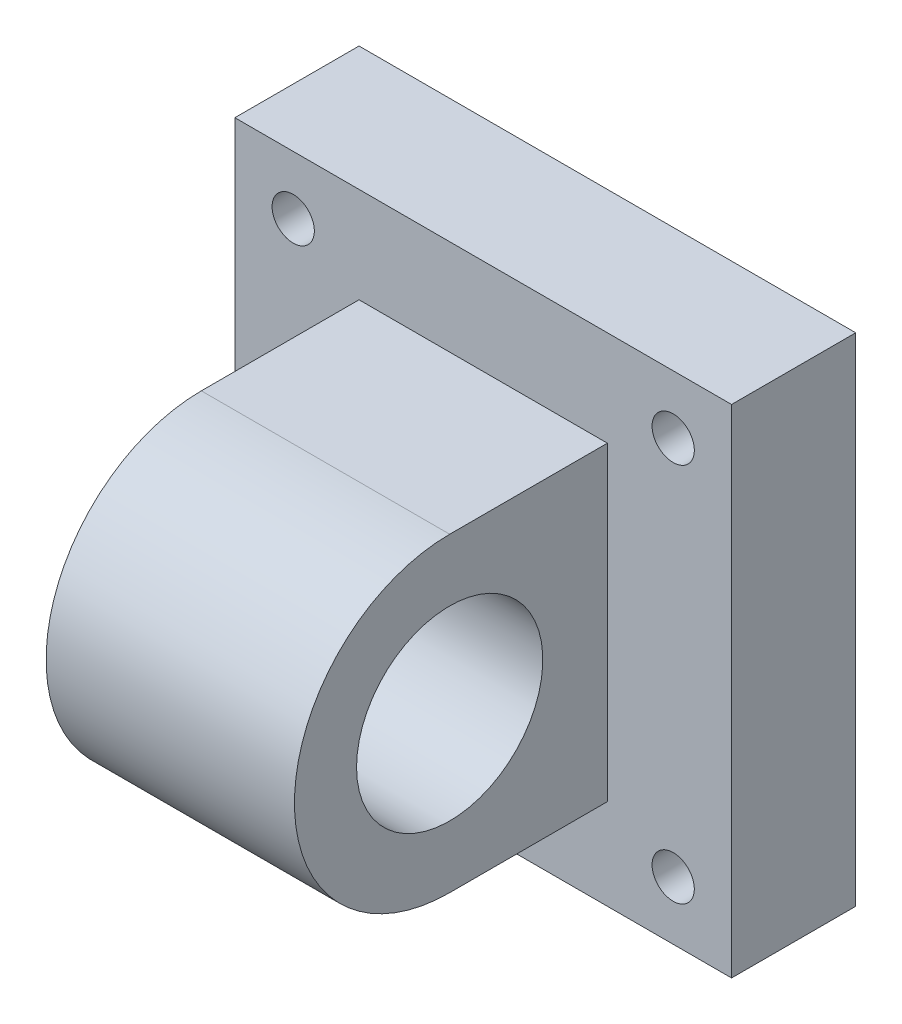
ISO-10303-21;
HEADER;
FILE_DESCRIPTION(('STEP AP214'),'2;1');
FILE_NAME('part.step','',(''),(''),'','','');
FILE_SCHEMA(('AUTOMOTIVE_DESIGN { 1 0 10303 214 1 1 1 1 }'));
ENDSEC;
DATA;
#1=APPLICATION_CONTEXT('core data for automotive mechanical design processes');
#2=APPLICATION_PROTOCOL_DEFINITION('international standard','automotive_design',2000,#1);
#3=PRODUCT_CONTEXT('',#1,'mechanical');
#4=PRODUCT('Part','Part','',(#3));
#5=PRODUCT_RELATED_PRODUCT_CATEGORY('part','',(#4));
#6=PRODUCT_DEFINITION_FORMATION('','',#4);
#7=PRODUCT_DEFINITION_CONTEXT('part definition',#1,'design');
#8=PRODUCT_DEFINITION('design','',#6,#7);
#9=PRODUCT_DEFINITION_SHAPE('','',#8);
#10=(LENGTH_UNIT() NAMED_UNIT(*) SI_UNIT(.MILLI.,.METRE.));
#11=(NAMED_UNIT(*) PLANE_ANGLE_UNIT() SI_UNIT($,.RADIAN.));
#12=(NAMED_UNIT(*) SI_UNIT($,.STERADIAN.) SOLID_ANGLE_UNIT());
#13=UNCERTAINTY_MEASURE_WITH_UNIT(LENGTH_MEASURE(1.E-05),#10,'distance_accuracy_value','');
#14=(GEOMETRIC_REPRESENTATION_CONTEXT(3) GLOBAL_UNCERTAINTY_ASSIGNED_CONTEXT((#13)) GLOBAL_UNIT_ASSIGNED_CONTEXT((#10,
#11,#12)) REPRESENTATION_CONTEXT('',''));
#15=CARTESIAN_POINT('',(0.,0.,0.));
#16=DIRECTION('',(0.,0.,1.));
#17=DIRECTION('',(1.,0.,0.));
#18=AXIS2_PLACEMENT_3D('',#15,#16,#17);
#19=CARTESIAN_POINT('',(0.,0.,10.));
#20=DIRECTION('',(0.,0.,-1.));
#21=DIRECTION('',(-1.,0.,0.));
#22=AXIS2_PLACEMENT_3D('',#19,#20,#21);
#23=PLANE('',#22);
#24=CARTESIAN_POINT('',(15.3,-15.3,10.));
#25=DIRECTION('',(0.,0.,-1.));
#26=DIRECTION('',(-1.,0.,0.));
#27=AXIS2_PLACEMENT_3D('',#24,#25,#26);
#28=CIRCLE('',#27,1.7);
#29=CARTESIAN_POINT('',(13.6,-15.3,10.));
#30=VERTEX_POINT('',#29);
#31=EDGE_CURVE('E244',#30,#30,#28,.T.);
#32=ORIENTED_EDGE('',*,*,#31,.T.);
#33=EDGE_LOOP('',(#32));
#34=FACE_BOUND('',#33,.T.);
#35=CARTESIAN_POINT('',(15.3,15.3,10.));
#36=DIRECTION('',(0.,0.,-1.));
#37=DIRECTION('',(-1.,0.,0.));
#38=AXIS2_PLACEMENT_3D('',#35,#36,#37);
#39=CIRCLE('',#38,1.7);
#40=CARTESIAN_POINT('',(13.6,15.3,10.));
#41=VERTEX_POINT('',#40);
#42=EDGE_CURVE('E248',#41,#41,#39,.F.);
#43=ORIENTED_EDGE('',*,*,#42,.F.);
#44=EDGE_LOOP('',(#43));
#45=FACE_BOUND('',#44,.T.);
#46=CARTESIAN_POINT('',(-15.3,-15.3,10.));
#47=DIRECTION('',(0.,0.,-1.));
#48=DIRECTION('',(-1.,0.,0.));
#49=AXIS2_PLACEMENT_3D('',#46,#47,#48);
#50=CIRCLE('',#49,1.7);
#51=CARTESIAN_POINT('',(-17.,-15.3,10.));
#52=VERTEX_POINT('',#51);
#53=EDGE_CURVE('E257',#52,#52,#50,.F.);
#54=ORIENTED_EDGE('',*,*,#53,.F.);
#55=EDGE_LOOP('',(#54));
#56=FACE_BOUND('',#55,.T.);
#57=CARTESIAN_POINT('',(-15.3,15.3,10.));
#58=DIRECTION('',(0.,0.,-1.));
#59=DIRECTION('',(-1.,0.,0.));
#60=AXIS2_PLACEMENT_3D('',#57,#58,#59);
#61=CIRCLE('',#60,1.7);
#62=CARTESIAN_POINT('',(-17.,15.3,10.));
#63=VERTEX_POINT('',#62);
#64=EDGE_CURVE('E133',#63,#63,#61,.T.);
#65=ORIENTED_EDGE('',*,*,#64,.T.);
#66=EDGE_LOOP('',(#65));
#67=FACE_BOUND('',#66,.T.);
#68=DIRECTION('',(0.,1.,0.));
#69=VECTOR('',#68,1.);
#70=CARTESIAN_POINT('',(20.,-20.,10.));
#71=LINE('',#70,#69);
#72=CARTESIAN_POINT('',(20.,-20.,10.));
#73=VERTEX_POINT('',#72);
#74=CARTESIAN_POINT('',(20.,20.,10.));
#75=VERTEX_POINT('',#74);
#76=EDGE_CURVE('E155',#73,#75,#71,.T.);
#77=ORIENTED_EDGE('',*,*,#76,.T.);
#78=DIRECTION('',(-1.,0.,0.));
#79=VECTOR('',#78,1.);
#80=CARTESIAN_POINT('',(-20.,20.,10.));
#81=LINE('',#80,#79);
#82=CARTESIAN_POINT('',(-20.,20.,10.));
#83=VERTEX_POINT('',#82);
#84=EDGE_CURVE('E87',#75,#83,#81,.T.);
#85=ORIENTED_EDGE('',*,*,#84,.T.);
#86=DIRECTION('',(0.,-1.,0.));
#87=VECTOR('',#86,1.);
#88=CARTESIAN_POINT('',(-20.,-20.,10.));
#89=LINE('',#88,#87);
#90=CARTESIAN_POINT('',(-20.,-20.,10.));
#91=VERTEX_POINT('',#90);
#92=EDGE_CURVE('E158',#83,#91,#89,.T.);
#93=ORIENTED_EDGE('',*,*,#92,.T.);
#94=DIRECTION('',(1.,0.,0.));
#95=VECTOR('',#94,1.);
#96=CARTESIAN_POINT('',(-20.,-20.,10.));
#97=LINE('',#96,#95);
#98=EDGE_CURVE('E59',#91,#73,#97,.T.);
#99=ORIENTED_EDGE('',*,*,#98,.T.);
#100=EDGE_LOOP('',(#77,#85,#93,#99));
#101=FACE_BOUND('',#100,.T.);
#102=DIRECTION('',(0.,1.,0.));
#103=VECTOR('',#102,1.);
#104=CARTESIAN_POINT('',(10.,0.,10.));
#105=LINE('',#104,#103);
#106=CARTESIAN_POINT('',(10.,-12.7,10.));
#107=VERTEX_POINT('',#106);
#108=CARTESIAN_POINT('',(10.,12.3,10.));
#109=VERTEX_POINT('',#108);
#110=EDGE_CURVE('E145',#107,#109,#105,.T.);
#111=ORIENTED_EDGE('',*,*,#110,.F.);
#112=DIRECTION('',(-1.,0.,0.));
#113=VECTOR('',#112,1.);
#114=CARTESIAN_POINT('',(10.,-12.7,10.));
#115=LINE('',#114,#113);
#116=CARTESIAN_POINT('',(-10.,-12.7,10.));
#117=VERTEX_POINT('',#116);
#118=EDGE_CURVE('E151',#107,#117,#115,.T.);
#119=ORIENTED_EDGE('',*,*,#118,.T.);
#120=DIRECTION('',(0.,1.,0.));
#121=VECTOR('',#120,1.);
#122=CARTESIAN_POINT('',(-10.,0.,10.));
#123=LINE('',#122,#121);
#124=CARTESIAN_POINT('',(-10.,12.3,10.));
#125=VERTEX_POINT('',#124);
#126=EDGE_CURVE('E125',#117,#125,#123,.T.);
#127=ORIENTED_EDGE('',*,*,#126,.T.);
#128=DIRECTION('',(-1.,0.,0.));
#129=VECTOR('',#128,1.);
#130=CARTESIAN_POINT('',(10.,12.3,10.));
#131=LINE('',#130,#129);
#132=EDGE_CURVE('E119',#109,#125,#131,.T.);
#133=ORIENTED_EDGE('',*,*,#132,.F.);
#134=EDGE_LOOP('',(#111,#119,#127,#133));
#135=FACE_BOUND('',#134,.T.);
#136=ADVANCED_FACE('F35',(#34,#45,#56,#67,#101,#135),#23,.F.);
#137=CARTESIAN_POINT('',(20.,-20.,10.));
#138=DIRECTION('',(-1.,0.,0.));
#139=DIRECTION('',(0.,0.,1.));
#140=AXIS2_PLACEMENT_3D('',#137,#138,#139);
#141=PLANE('',#140);
#142=DIRECTION('',(0.,1.,0.));
#143=VECTOR('',#142,1.);
#144=CARTESIAN_POINT('',(20.,-20.,0.));
#145=LINE('',#144,#143);
#146=CARTESIAN_POINT('',(20.,-20.,0.));
#147=VERTEX_POINT('',#146);
#148=CARTESIAN_POINT('',(20.,20.,0.));
#149=VERTEX_POINT('',#148);
#150=EDGE_CURVE('E150',#147,#149,#145,.T.);
#151=ORIENTED_EDGE('',*,*,#150,.T.);
#152=DIRECTION('',(0.,0.,-1.));
#153=VECTOR('',#152,1.);
#154=CARTESIAN_POINT('',(20.,20.,10.));
#155=LINE('',#154,#153);
#156=EDGE_CURVE('E11',#75,#149,#155,.T.);
#157=ORIENTED_EDGE('',*,*,#156,.F.);
#158=ORIENTED_EDGE('',*,*,#76,.F.);
#159=DIRECTION('',(0.,0.,-1.));
#160=VECTOR('',#159,1.);
#161=CARTESIAN_POINT('',(20.,-20.,10.));
#162=LINE('',#161,#160);
#163=EDGE_CURVE('E161',#73,#147,#162,.T.);
#164=ORIENTED_EDGE('',*,*,#163,.T.);
#165=EDGE_LOOP('',(#151,#157,#158,#164));
#166=FACE_BOUND('',#165,.T.);
#167=ADVANCED_FACE('F37',(#166),#141,.F.);
#168=CARTESIAN_POINT('',(-20.,20.,10.));
#169=DIRECTION('',(0.,-1.,0.));
#170=DIRECTION('',(0.,0.,-1.));
#171=AXIS2_PLACEMENT_3D('',#168,#169,#170);
#172=PLANE('',#171);
#173=DIRECTION('',(-1.,0.,0.));
#174=VECTOR('',#173,1.);
#175=CARTESIAN_POINT('',(-20.,20.,0.));
#176=LINE('',#175,#174);
#177=CARTESIAN_POINT('',(-20.,20.,0.));
#178=VERTEX_POINT('',#177);
#179=EDGE_CURVE('E164',#149,#178,#176,.T.);
#180=ORIENTED_EDGE('',*,*,#179,.T.);
#181=DIRECTION('',(0.,0.,-1.));
#182=VECTOR('',#181,1.);
#183=CARTESIAN_POINT('',(-20.,20.,10.));
#184=LINE('',#183,#182);
#185=EDGE_CURVE('E43',#83,#178,#184,.T.);
#186=ORIENTED_EDGE('',*,*,#185,.F.);
#187=ORIENTED_EDGE('',*,*,#84,.F.);
#188=ORIENTED_EDGE('',*,*,#156,.T.);
#189=EDGE_LOOP('',(#180,#186,#187,#188));
#190=FACE_BOUND('',#189,.T.);
#191=ADVANCED_FACE('F192',(#190),#172,.F.);
#192=CARTESIAN_POINT('',(-20.,-20.,10.));
#193=DIRECTION('',(1.,0.,0.));
#194=DIRECTION('',(0.,0.,-1.));
#195=AXIS2_PLACEMENT_3D('',#192,#193,#194);
#196=PLANE('',#195);
#197=DIRECTION('',(0.,-1.,0.));
#198=VECTOR('',#197,1.);
#199=CARTESIAN_POINT('',(-20.,-20.,0.));
#200=LINE('',#199,#198);
#201=CARTESIAN_POINT('',(-20.,-20.,0.));
#202=VERTEX_POINT('',#201);
#203=EDGE_CURVE('E166',#178,#202,#200,.T.);
#204=ORIENTED_EDGE('',*,*,#203,.T.);
#205=DIRECTION('',(0.,0.,-1.));
#206=VECTOR('',#205,1.);
#207=CARTESIAN_POINT('',(-20.,-20.,10.));
#208=LINE('',#207,#206);
#209=EDGE_CURVE('E170',#91,#202,#208,.T.);
#210=ORIENTED_EDGE('',*,*,#209,.F.);
#211=ORIENTED_EDGE('',*,*,#92,.F.);
#212=ORIENTED_EDGE('',*,*,#185,.T.);
#213=EDGE_LOOP('',(#204,#210,#211,#212));
#214=FACE_BOUND('',#213,.T.);
#215=ADVANCED_FACE('F175',(#214),#196,.F.);
#216=CARTESIAN_POINT('',(-20.,-20.,10.));
#217=DIRECTION('',(0.,1.,0.));
#218=DIRECTION('',(0.,0.,1.));
#219=AXIS2_PLACEMENT_3D('',#216,#217,#218);
#220=PLANE('',#219);
#221=DIRECTION('',(1.,0.,0.));
#222=VECTOR('',#221,1.);
#223=CARTESIAN_POINT('',(-20.,-20.,0.));
#224=LINE('',#223,#222);
#225=EDGE_CURVE('E80',#202,#147,#224,.T.);
#226=ORIENTED_EDGE('',*,*,#225,.T.);
#227=ORIENTED_EDGE('',*,*,#163,.F.);
#228=ORIENTED_EDGE('',*,*,#98,.F.);
#229=ORIENTED_EDGE('',*,*,#209,.T.);
#230=EDGE_LOOP('',(#226,#227,#228,#229));
#231=FACE_BOUND('',#230,.T.);
#232=ADVANCED_FACE('F183',(#231),#220,.F.);
#233=CARTESIAN_POINT('',(0.,0.,0.));
#234=DIRECTION('',(0.,0.,-1.));
#235=DIRECTION('',(-1.,0.,0.));
#236=AXIS2_PLACEMENT_3D('',#233,#234,#235);
#237=PLANE('',#236);
#238=CARTESIAN_POINT('',(15.3,-15.3,0.));
#239=DIRECTION('',(0.,0.,-1.));
#240=DIRECTION('',(1.,0.,0.));
#241=AXIS2_PLACEMENT_3D('',#238,#239,#240);
#242=CIRCLE('',#241,1.7);
#243=CARTESIAN_POINT('',(17.,-15.3,0.));
#244=VERTEX_POINT('',#243);
#245=EDGE_CURVE('E242',#244,#244,#242,.T.);
#246=ORIENTED_EDGE('',*,*,#245,.F.);
#247=EDGE_LOOP('',(#246));
#248=FACE_BOUND('',#247,.T.);
#249=CARTESIAN_POINT('',(15.3,15.3,0.));
#250=DIRECTION('',(0.,0.,1.));
#251=DIRECTION('',(1.,0.,0.));
#252=AXIS2_PLACEMENT_3D('',#249,#250,#251);
#253=CIRCLE('',#252,1.7);
#254=CARTESIAN_POINT('',(17.,15.3,0.));
#255=VERTEX_POINT('',#254);
#256=EDGE_CURVE('E245',#255,#255,#253,.T.);
#257=ORIENTED_EDGE('',*,*,#256,.T.);
#258=EDGE_LOOP('',(#257));
#259=FACE_BOUND('',#258,.T.);
#260=CARTESIAN_POINT('',(-15.3,-15.3,0.));
#261=DIRECTION('',(0.,0.,1.));
#262=DIRECTION('',(-1.,0.,0.));
#263=AXIS2_PLACEMENT_3D('',#260,#261,#262);
#264=CIRCLE('',#263,1.7);
#265=CARTESIAN_POINT('',(-17.,-15.3,0.));
#266=VERTEX_POINT('',#265);
#267=EDGE_CURVE('E254',#266,#266,#264,.T.);
#268=ORIENTED_EDGE('',*,*,#267,.T.);
#269=EDGE_LOOP('',(#268));
#270=FACE_BOUND('',#269,.T.);
#271=CARTESIAN_POINT('',(-15.3,15.3,0.));
#272=DIRECTION('',(0.,0.,-1.));
#273=DIRECTION('',(-1.,0.,0.));
#274=AXIS2_PLACEMENT_3D('',#271,#272,#273);
#275=CIRCLE('',#274,1.7);
#276=CARTESIAN_POINT('',(-17.,15.3,0.));
#277=VERTEX_POINT('',#276);
#278=EDGE_CURVE('E260',#277,#277,#275,.T.);
#279=ORIENTED_EDGE('',*,*,#278,.F.);
#280=EDGE_LOOP('',(#279));
#281=FACE_BOUND('',#280,.T.);
#282=ORIENTED_EDGE('',*,*,#150,.F.);
#283=ORIENTED_EDGE('',*,*,#225,.F.);
#284=ORIENTED_EDGE('',*,*,#203,.F.);
#285=ORIENTED_EDGE('',*,*,#179,.F.);
#286=EDGE_LOOP('',(#282,#283,#284,#285));
#287=FACE_BOUND('',#286,.T.);
#288=ADVANCED_FACE('F179',(#248,#259,#270,#281,#287),#237,.T.);
#289=CARTESIAN_POINT('',(10.,-0.199999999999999,22.7));
#290=DIRECTION('',(-1.,0.,0.));
#291=DIRECTION('',(0.,0.,1.));
#292=AXIS2_PLACEMENT_3D('',#289,#290,#291);
#293=CYLINDRICAL_SURFACE('',#292,12.5);
#294=DIRECTION('',(-1.,0.,0.));
#295=VECTOR('',#294,1.);
#296=CARTESIAN_POINT('',(10.,12.3,22.7));
#297=LINE('',#296,#295);
#298=CARTESIAN_POINT('',(10.,12.3,22.7));
#299=VERTEX_POINT('',#298);
#300=CARTESIAN_POINT('',(-10.,12.3,22.7));
#301=VERTEX_POINT('',#300);
#302=EDGE_CURVE('E110',#299,#301,#297,.T.);
#303=ORIENTED_EDGE('',*,*,#302,.T.);
#304=CARTESIAN_POINT('',(-10.,-0.199999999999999,22.7));
#305=DIRECTION('',(-1.,0.,0.));
#306=DIRECTION('',(0.,0.,1.));
#307=AXIS2_PLACEMENT_3D('',#304,#305,#306);
#308=CIRCLE('',#307,12.5);
#309=CARTESIAN_POINT('',(-10.,-12.7,22.7));
#310=VERTEX_POINT('',#309);
#311=EDGE_CURVE('E112',#310,#301,#308,.T.);
#312=ORIENTED_EDGE('',*,*,#311,.F.);
#313=DIRECTION('',(-1.,0.,0.));
#314=VECTOR('',#313,1.);
#315=CARTESIAN_POINT('',(10.,-12.7,22.7));
#316=LINE('',#315,#314);
#317=CARTESIAN_POINT('',(10.,-12.7,22.7));
#318=VERTEX_POINT('',#317);
#319=EDGE_CURVE('E148',#318,#310,#316,.T.);
#320=ORIENTED_EDGE('',*,*,#319,.F.);
#321=CARTESIAN_POINT('',(10.,-0.199999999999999,22.7));
#322=DIRECTION('',(-1.,0.,0.));
#323=DIRECTION('',(0.,0.,1.));
#324=AXIS2_PLACEMENT_3D('',#321,#322,#323);
#325=CIRCLE('',#324,12.5);
#326=EDGE_CURVE('E115',#318,#299,#325,.T.);
#327=ORIENTED_EDGE('',*,*,#326,.T.);
#328=EDGE_LOOP('',(#303,#312,#320,#327));
#329=FACE_BOUND('',#328,.T.);
#330=ADVANCED_FACE('F111',(#329),#293,.T.);
#331=CARTESIAN_POINT('',(10.,-12.7,0.));
#332=DIRECTION('',(0.,1.,0.));
#333=DIRECTION('',(0.,0.,1.));
#334=AXIS2_PLACEMENT_3D('',#331,#332,#333);
#335=PLANE('',#334);
#336=ORIENTED_EDGE('',*,*,#319,.T.);
#337=DIRECTION('',(0.,0.,-1.));
#338=VECTOR('',#337,1.);
#339=CARTESIAN_POINT('',(-10.,-12.7,0.));
#340=LINE('',#339,#338);
#341=EDGE_CURVE('E129',#310,#117,#340,.T.);
#342=ORIENTED_EDGE('',*,*,#341,.T.);
#343=ORIENTED_EDGE('',*,*,#118,.F.);
#344=DIRECTION('',(0.,0.,-1.));
#345=VECTOR('',#344,1.);
#346=CARTESIAN_POINT('',(10.,-12.7,0.));
#347=LINE('',#346,#345);
#348=EDGE_CURVE('E120',#318,#107,#347,.T.);
#349=ORIENTED_EDGE('',*,*,#348,.F.);
#350=EDGE_LOOP('',(#336,#342,#343,#349));
#351=FACE_BOUND('',#350,.T.);
#352=ADVANCED_FACE('F206',(#351),#335,.F.);
#353=CARTESIAN_POINT('',(10.,-0.199999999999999,22.7));
#354=DIRECTION('',(-1.,0.,0.));
#355=DIRECTION('',(0.,0.,1.));
#356=AXIS2_PLACEMENT_3D('',#353,#354,#355);
#357=CYLINDRICAL_SURFACE('',#356,7.5);
#358=CARTESIAN_POINT('',(10.,-0.199999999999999,22.7));
#359=DIRECTION('',(-1.,0.,0.));
#360=DIRECTION('',(0.,0.,1.));
#361=AXIS2_PLACEMENT_3D('',#358,#359,#360);
#362=CIRCLE('',#361,7.5);
#363=CARTESIAN_POINT('',(10.,-0.199999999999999,30.2));
#364=VERTEX_POINT('',#363);
#365=EDGE_CURVE('E139',#364,#364,#362,.T.);
#366=ORIENTED_EDGE('',*,*,#365,.F.);
#367=EDGE_LOOP('',(#366));
#368=FACE_BOUND('',#367,.T.);
#369=CARTESIAN_POINT('',(-10.,-0.199999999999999,22.7));
#370=DIRECTION('',(-1.,0.,0.));
#371=DIRECTION('',(0.,0.,1.));
#372=AXIS2_PLACEMENT_3D('',#369,#370,#371);
#373=CIRCLE('',#372,7.5);
#374=CARTESIAN_POINT('',(-10.,-0.199999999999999,30.2));
#375=VERTEX_POINT('',#374);
#376=EDGE_CURVE('E130',#375,#375,#373,.T.);
#377=ORIENTED_EDGE('',*,*,#376,.T.);
#378=EDGE_LOOP('',(#377));
#379=FACE_BOUND('',#378,.T.);
#380=ADVANCED_FACE('F203',(#368,#379),#357,.F.);
#381=CARTESIAN_POINT('',(10.,12.3,0.));
#382=DIRECTION('',(0.,1.,0.));
#383=DIRECTION('',(0.,0.,1.));
#384=AXIS2_PLACEMENT_3D('',#381,#382,#383);
#385=PLANE('',#384);
#386=ORIENTED_EDGE('',*,*,#132,.T.);
#387=DIRECTION('',(0.,0.,-1.));
#388=VECTOR('',#387,1.);
#389=CARTESIAN_POINT('',(-10.,12.3,0.));
#390=LINE('',#389,#388);
#391=EDGE_CURVE('E50',#301,#125,#390,.T.);
#392=ORIENTED_EDGE('',*,*,#391,.F.);
#393=ORIENTED_EDGE('',*,*,#302,.F.);
#394=DIRECTION('',(0.,0.,-1.));
#395=VECTOR('',#394,1.);
#396=CARTESIAN_POINT('',(10.,12.3,0.));
#397=LINE('',#396,#395);
#398=EDGE_CURVE('E143',#299,#109,#397,.T.);
#399=ORIENTED_EDGE('',*,*,#398,.T.);
#400=EDGE_LOOP('',(#386,#392,#393,#399));
#401=FACE_BOUND('',#400,.T.);
#402=ADVANCED_FACE('F122',(#401),#385,.T.);
#403=CARTESIAN_POINT('',(10.,0.,0.));
#404=DIRECTION('',(-1.,0.,0.));
#405=DIRECTION('',(0.,0.,1.));
#406=AXIS2_PLACEMENT_3D('',#403,#404,#405);
#407=PLANE('',#406);
#408=ORIENTED_EDGE('',*,*,#365,.T.);
#409=EDGE_LOOP('',(#408));
#410=FACE_BOUND('',#409,.T.);
#411=ORIENTED_EDGE('',*,*,#326,.F.);
#412=ORIENTED_EDGE('',*,*,#348,.T.);
#413=ORIENTED_EDGE('',*,*,#110,.T.);
#414=ORIENTED_EDGE('',*,*,#398,.F.);
#415=EDGE_LOOP('',(#411,#412,#413,#414));
#416=FACE_BOUND('',#415,.T.);
#417=ADVANCED_FACE('F212',(#410,#416),#407,.F.);
#418=CARTESIAN_POINT('',(-10.,0.,0.));
#419=DIRECTION('',(-1.,0.,0.));
#420=DIRECTION('',(0.,0.,1.));
#421=AXIS2_PLACEMENT_3D('',#418,#419,#420);
#422=PLANE('',#421);
#423=ORIENTED_EDGE('',*,*,#376,.F.);
#424=EDGE_LOOP('',(#423));
#425=FACE_BOUND('',#424,.T.);
#426=ORIENTED_EDGE('',*,*,#311,.T.);
#427=ORIENTED_EDGE('',*,*,#391,.T.);
#428=ORIENTED_EDGE('',*,*,#126,.F.);
#429=ORIENTED_EDGE('',*,*,#341,.F.);
#430=EDGE_LOOP('',(#426,#427,#428,#429));
#431=FACE_BOUND('',#430,.T.);
#432=ADVANCED_FACE('F127',(#425,#431),#422,.T.);
#433=CARTESIAN_POINT('',(-15.3,15.3,20.));
#434=DIRECTION('',(0.,0.,-1.));
#435=DIRECTION('',(-1.,0.,0.));
#436=AXIS2_PLACEMENT_3D('',#433,#434,#435);
#437=CYLINDRICAL_SURFACE('',#436,1.7);
#438=ORIENTED_EDGE('',*,*,#278,.T.);
#439=EDGE_LOOP('',(#438));
#440=FACE_BOUND('',#439,.T.);
#441=ORIENTED_EDGE('',*,*,#64,.F.);
#442=EDGE_LOOP('',(#441));
#443=FACE_BOUND('',#442,.T.);
#444=ADVANCED_FACE('F221',(#440,#443),#437,.F.);
#445=CARTESIAN_POINT('',(-15.3,-15.3,20.));
#446=DIRECTION('',(0.,0.,-1.));
#447=DIRECTION('',(-1.,0.,0.));
#448=AXIS2_PLACEMENT_3D('',#445,#446,#447);
#449=CYLINDRICAL_SURFACE('',#448,1.7);
#450=ORIENTED_EDGE('',*,*,#267,.F.);
#451=EDGE_LOOP('',(#450));
#452=FACE_BOUND('',#451,.T.);
#453=ORIENTED_EDGE('',*,*,#53,.T.);
#454=EDGE_LOOP('',(#453));
#455=FACE_BOUND('',#454,.T.);
#456=ADVANCED_FACE('F225',(#452,#455),#449,.F.);
#457=CARTESIAN_POINT('',(15.3,15.3,20.));
#458=DIRECTION('',(0.,0.,-1.));
#459=DIRECTION('',(-1.,0.,0.));
#460=AXIS2_PLACEMENT_3D('',#457,#458,#459);
#461=CYLINDRICAL_SURFACE('',#460,1.7);
#462=ORIENTED_EDGE('',*,*,#256,.F.);
#463=EDGE_LOOP('',(#462));
#464=FACE_BOUND('',#463,.T.);
#465=ORIENTED_EDGE('',*,*,#42,.T.);
#466=EDGE_LOOP('',(#465));
#467=FACE_BOUND('',#466,.T.);
#468=ADVANCED_FACE('F229',(#464,#467),#461,.F.);
#469=CARTESIAN_POINT('',(15.3,-15.3,20.));
#470=DIRECTION('',(0.,0.,-1.));
#471=DIRECTION('',(-1.,0.,0.));
#472=AXIS2_PLACEMENT_3D('',#469,#470,#471);
#473=CYLINDRICAL_SURFACE('',#472,1.7);
#474=ORIENTED_EDGE('',*,*,#245,.T.);
#475=EDGE_LOOP('',(#474));
#476=FACE_BOUND('',#475,.T.);
#477=ORIENTED_EDGE('',*,*,#31,.F.);
#478=EDGE_LOOP('',(#477));
#479=FACE_BOUND('',#478,.T.);
#480=ADVANCED_FACE('F233',(#476,#479),#473,.F.);
#481=CLOSED_SHELL('',(#136,#167,#191,#215,#232,#288,#330,#352,#380,#402,#417,#432,#444,#456,
#468,#480));
#482=MANIFOLD_SOLID_BREP('B2',#481);
#483=ADVANCED_BREP_SHAPE_REPRESENTATION('',(#18,#482),#14);
#484=SHAPE_DEFINITION_REPRESENTATION(#9,#483);
ENDSEC;
END-ISO-10303-21;
